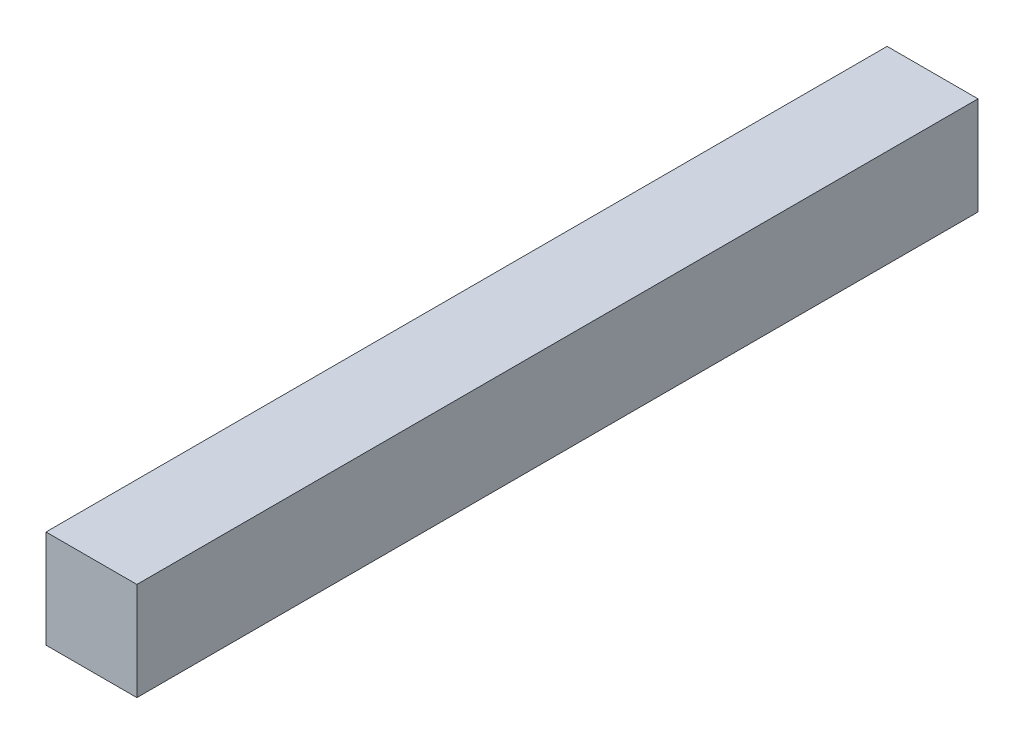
ISO-10303-21;
HEADER;
FILE_DESCRIPTION(('STEP AP214'),'2;1');
FILE_NAME('part.step','',(''),(''),'','','');
FILE_SCHEMA(('AUTOMOTIVE_DESIGN { 1 0 10303 214 1 1 1 1 }'));
ENDSEC;
DATA;
#1=APPLICATION_CONTEXT('core data for automotive mechanical design processes');
#2=APPLICATION_PROTOCOL_DEFINITION('international standard','automotive_design',2000,#1);
#3=PRODUCT_CONTEXT('',#1,'mechanical');
#4=PRODUCT('Part','Part','',(#3));
#5=PRODUCT_RELATED_PRODUCT_CATEGORY('part','',(#4));
#6=PRODUCT_DEFINITION_FORMATION('','',#4);
#7=PRODUCT_DEFINITION_CONTEXT('part definition',#1,'design');
#8=PRODUCT_DEFINITION('design','',#6,#7);
#9=PRODUCT_DEFINITION_SHAPE('','',#8);
#10=(LENGTH_UNIT() NAMED_UNIT(*) SI_UNIT(.MILLI.,.METRE.));
#11=(NAMED_UNIT(*) PLANE_ANGLE_UNIT() SI_UNIT($,.RADIAN.));
#12=(NAMED_UNIT(*) SI_UNIT($,.STERADIAN.) SOLID_ANGLE_UNIT());
#13=UNCERTAINTY_MEASURE_WITH_UNIT(LENGTH_MEASURE(1.E-05),#10,'distance_accuracy_value','');
#14=(GEOMETRIC_REPRESENTATION_CONTEXT(3) GLOBAL_UNCERTAINTY_ASSIGNED_CONTEXT((#13)) GLOBAL_UNIT_ASSIGNED_CONTEXT((#10,
#11,#12)) REPRESENTATION_CONTEXT('',''));
#15=CARTESIAN_POINT('',(0.,0.,0.));
#16=DIRECTION('',(0.,0.,1.));
#17=DIRECTION('',(1.,0.,0.));
#18=AXIS2_PLACEMENT_3D('',#15,#16,#17);
#19=CARTESIAN_POINT('',(0.,0.,0.));
#20=DIRECTION('',(0.,0.,1.));
#21=DIRECTION('',(1.,0.,0.));
#22=AXIS2_PLACEMENT_3D('',#19,#20,#21);
#23=PLANE('',#22);
#24=DIRECTION('',(0.,-1.,0.));
#25=VECTOR('',#24,1.);
#26=CARTESIAN_POINT('',(-3.81477497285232,-4.11551103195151,0.));
#27=LINE('',#26,#25);
#28=CARTESIAN_POINT('',(-3.81477497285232,4.11551103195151,0.));
#29=VERTEX_POINT('',#28);
#30=CARTESIAN_POINT('',(-3.81477497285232,-4.11551103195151,0.));
#31=VERTEX_POINT('',#30);
#32=EDGE_CURVE('E83',#29,#31,#27,.T.);
#33=ORIENTED_EDGE('',*,*,#32,.F.);
#34=DIRECTION('',(-1.,0.,0.));
#35=VECTOR('',#34,1.);
#36=CARTESIAN_POINT('',(3.81477497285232,4.11551103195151,0.));
#37=LINE('',#36,#35);
#38=CARTESIAN_POINT('',(3.81477497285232,4.11551103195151,0.));
#39=VERTEX_POINT('',#38);
#40=EDGE_CURVE('E94',#39,#29,#37,.T.);
#41=ORIENTED_EDGE('',*,*,#40,.F.);
#42=DIRECTION('',(0.,1.,0.));
#43=VECTOR('',#42,1.);
#44=CARTESIAN_POINT('',(3.81477497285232,-4.11551103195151,0.));
#45=LINE('',#44,#43);
#46=CARTESIAN_POINT('',(3.81477497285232,-4.11551103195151,0.));
#47=VERTEX_POINT('',#46);
#48=EDGE_CURVE('E85',#47,#39,#45,.T.);
#49=ORIENTED_EDGE('',*,*,#48,.F.);
#50=DIRECTION('',(1.,0.,0.));
#51=VECTOR('',#50,1.);
#52=CARTESIAN_POINT('',(3.81477497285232,-4.11551103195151,0.));
#53=LINE('',#52,#51);
#54=EDGE_CURVE('E75',#31,#47,#53,.T.);
#55=ORIENTED_EDGE('',*,*,#54,.F.);
#56=EDGE_LOOP('',(#33,#41,#49,#55));
#57=FACE_BOUND('',#56,.T.);
#58=ADVANCED_FACE('F33',(#57),#23,.F.);
#59=CARTESIAN_POINT('',(3.81477497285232,4.11551103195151,81.8387103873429));
#60=DIRECTION('',(0.,-1.,0.));
#61=DIRECTION('',(0.,0.,-1.));
#62=AXIS2_PLACEMENT_3D('',#59,#60,#61);
#63=PLANE('',#62);
#64=DIRECTION('',(0.,0.,-1.));
#65=VECTOR('',#64,1.);
#66=CARTESIAN_POINT('',(-3.81477497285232,4.11551103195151,81.8387103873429));
#67=LINE('',#66,#65);
#68=CARTESIAN_POINT('',(-3.81477497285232,4.11551103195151,70.6155309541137));
#69=VERTEX_POINT('',#68);
#70=EDGE_CURVE('E88',#69,#29,#67,.T.);
#71=ORIENTED_EDGE('',*,*,#70,.F.);
#72=DIRECTION('',(1.,0.,0.));
#73=VECTOR('',#72,1.);
#74=CARTESIAN_POINT('',(3.81477497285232,4.11551103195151,70.6155309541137));
#75=LINE('',#74,#73);
#76=CARTESIAN_POINT('',(3.81477497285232,4.11551103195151,70.6155309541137));
#77=VERTEX_POINT('',#76);
#78=EDGE_CURVE('E37',#69,#77,#75,.T.);
#79=ORIENTED_EDGE('',*,*,#78,.T.);
#80=DIRECTION('',(0.,0.,-1.));
#81=VECTOR('',#80,1.);
#82=CARTESIAN_POINT('',(3.81477497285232,4.11551103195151,81.8387103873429));
#83=LINE('',#82,#81);
#84=EDGE_CURVE('E97',#77,#39,#83,.T.);
#85=ORIENTED_EDGE('',*,*,#84,.T.);
#86=ORIENTED_EDGE('',*,*,#40,.T.);
#87=EDGE_LOOP('',(#71,#79,#85,#86));
#88=FACE_BOUND('',#87,.T.);
#89=ADVANCED_FACE('F106',(#88),#63,.F.);
#90=CARTESIAN_POINT('',(3.81477497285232,-4.11551103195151,81.8387103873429));
#91=DIRECTION('',(-1.,0.,0.));
#92=DIRECTION('',(0.,0.,1.));
#93=AXIS2_PLACEMENT_3D('',#90,#91,#92);
#94=PLANE('',#93);
#95=ORIENTED_EDGE('',*,*,#84,.F.);
#96=DIRECTION('',(0.,-1.,0.));
#97=VECTOR('',#96,1.);
#98=CARTESIAN_POINT('',(3.81477497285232,-4.11551103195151,70.6155309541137));
#99=LINE('',#98,#97);
#100=CARTESIAN_POINT('',(3.81477497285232,-4.11551103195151,70.6155309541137));
#101=VERTEX_POINT('',#100);
#102=EDGE_CURVE('E103',#77,#101,#99,.T.);
#103=ORIENTED_EDGE('',*,*,#102,.T.);
#104=DIRECTION('',(0.,0.,-1.));
#105=VECTOR('',#104,1.);
#106=CARTESIAN_POINT('',(3.81477497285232,-4.11551103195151,81.8387103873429));
#107=LINE('',#106,#105);
#108=EDGE_CURVE('E79',#101,#47,#107,.T.);
#109=ORIENTED_EDGE('',*,*,#108,.T.);
#110=ORIENTED_EDGE('',*,*,#48,.T.);
#111=EDGE_LOOP('',(#95,#103,#109,#110));
#112=FACE_BOUND('',#111,.T.);
#113=ADVANCED_FACE('F102',(#112),#94,.F.);
#114=CARTESIAN_POINT('',(3.81477497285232,-4.11551103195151,81.8387103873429));
#115=DIRECTION('',(0.,1.,0.));
#116=DIRECTION('',(0.,0.,1.));
#117=AXIS2_PLACEMENT_3D('',#114,#115,#116);
#118=PLANE('',#117);
#119=ORIENTED_EDGE('',*,*,#108,.F.);
#120=DIRECTION('',(-1.,0.,0.));
#121=VECTOR('',#120,1.);
#122=CARTESIAN_POINT('',(3.81477497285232,-4.11551103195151,70.6155309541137));
#123=LINE('',#122,#121);
#124=CARTESIAN_POINT('',(-3.81477497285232,-4.11551103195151,70.6155309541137));
#125=VERTEX_POINT('',#124);
#126=EDGE_CURVE('E42',#101,#125,#123,.T.);
#127=ORIENTED_EDGE('',*,*,#126,.T.);
#128=DIRECTION('',(0.,0.,-1.));
#129=VECTOR('',#128,1.);
#130=CARTESIAN_POINT('',(-3.81477497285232,-4.11551103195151,81.8387103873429));
#131=LINE('',#130,#129);
#132=EDGE_CURVE('E72',#125,#31,#131,.T.);
#133=ORIENTED_EDGE('',*,*,#132,.T.);
#134=ORIENTED_EDGE('',*,*,#54,.T.);
#135=EDGE_LOOP('',(#119,#127,#133,#134));
#136=FACE_BOUND('',#135,.T.);
#137=ADVANCED_FACE('F74',(#136),#118,.F.);
#138=CARTESIAN_POINT('',(-3.81477497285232,-4.11551103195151,81.8387103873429));
#139=DIRECTION('',(1.,0.,0.));
#140=DIRECTION('',(0.,0.,-1.));
#141=AXIS2_PLACEMENT_3D('',#138,#139,#140);
#142=PLANE('',#141);
#143=ORIENTED_EDGE('',*,*,#132,.F.);
#144=DIRECTION('',(0.,1.,0.));
#145=VECTOR('',#144,1.);
#146=CARTESIAN_POINT('',(-3.81477497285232,-4.11551103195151,70.6155309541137));
#147=LINE('',#146,#145);
#148=EDGE_CURVE('E11',#125,#69,#147,.T.);
#149=ORIENTED_EDGE('',*,*,#148,.T.);
#150=ORIENTED_EDGE('',*,*,#70,.T.);
#151=ORIENTED_EDGE('',*,*,#32,.T.);
#152=EDGE_LOOP('',(#143,#149,#150,#151));
#153=FACE_BOUND('',#152,.T.);
#154=ADVANCED_FACE('F35',(#153),#142,.F.);
#155=CARTESIAN_POINT('',(1.59665849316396,-2.15713274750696,70.6155309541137));
#156=DIRECTION('',(0.,0.,-1.));
#157=DIRECTION('',(0.,1.,0.));
#158=AXIS2_PLACEMENT_3D('',#155,#156,#157);
#159=PLANE('',#158);
#160=ORIENTED_EDGE('',*,*,#126,.F.);
#161=ORIENTED_EDGE('',*,*,#102,.F.);
#162=ORIENTED_EDGE('',*,*,#78,.F.);
#163=ORIENTED_EDGE('',*,*,#148,.F.);
#164=EDGE_LOOP('',(#160,#161,#162,#163));
#165=FACE_BOUND('',#164,.T.);
#166=ADVANCED_FACE('F120',(#165),#159,.F.);
#167=CLOSED_SHELL('',(#58,#89,#113,#137,#154,#166));
#168=MANIFOLD_SOLID_BREP('B2',#167);
#169=ADVANCED_BREP_SHAPE_REPRESENTATION('',(#18,#168),#14);
#170=SHAPE_DEFINITION_REPRESENTATION(#9,#169);
ENDSEC;
END-ISO-10303-21;
